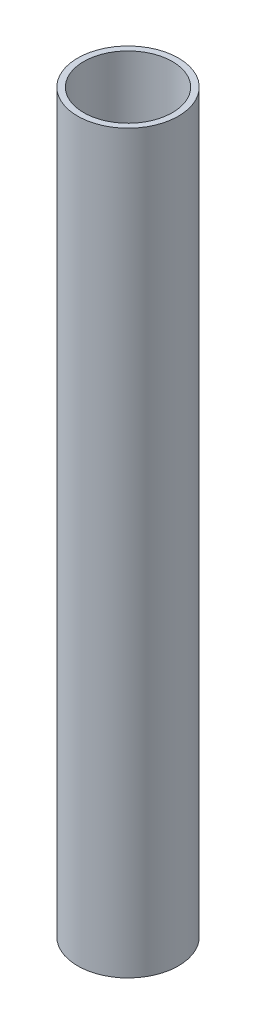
from build123d import *

# Parameters (mm, degrees)
SKETCH2_R           = 8.35
SKETCH2_R_2         = 7.35
BOSS_EXTRUDE1_DEPTH = 122


with BuildPart() as part:
    # Sketch2 → Boss-Extrude1 (new body)
    with BuildSketch(Plane(origin=(0, 0, 0), x_dir=(1, 0, 0), z_dir=(0, 1, 0))):
        with Locations(Location((0, 0, 0), (0, 0, 90))):
            Circle(SKETCH2_R)
        with Locations(Location((0, 0, 0), (0, 0, 90))):
            Circle(SKETCH2_R_2, mode=Mode.SUBTRACT)
    extrude(amount=BOSS_EXTRUDE1_DEPTH)


solid = part.part
